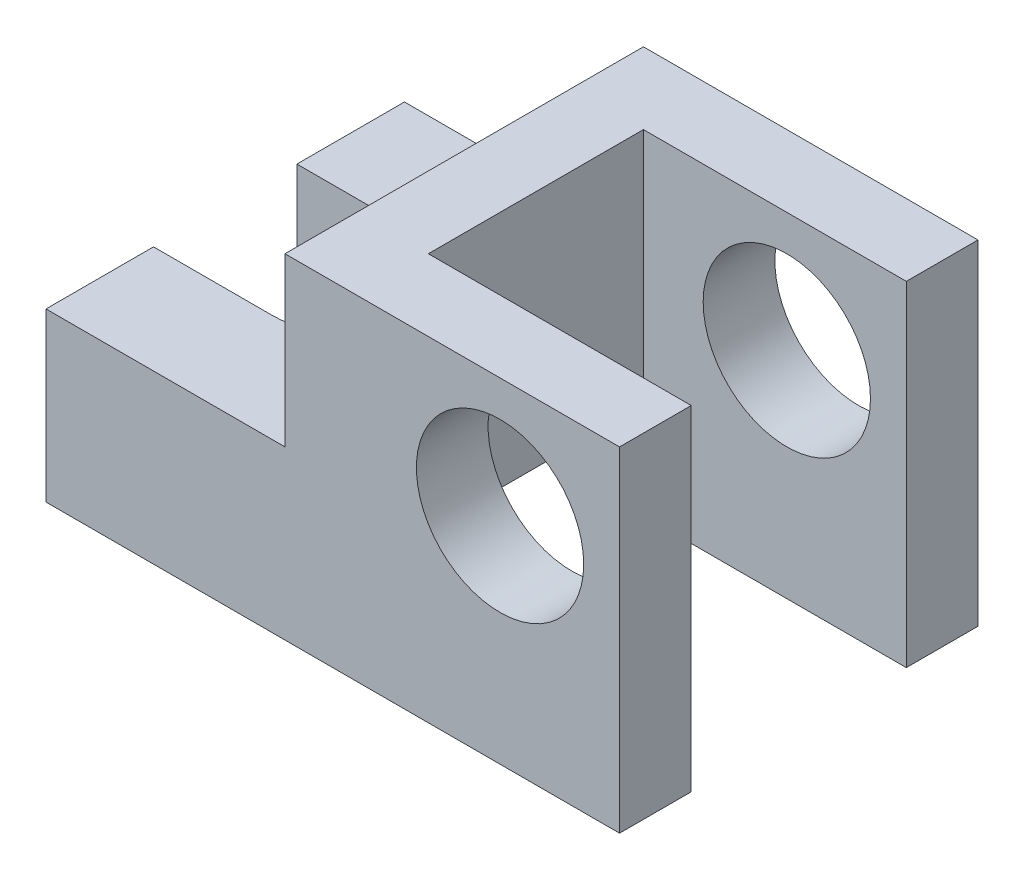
ISO-10303-21;
HEADER;
FILE_DESCRIPTION(('STEP AP214'),'2;1');
FILE_NAME('part.step','',(''),(''),'','','');
FILE_SCHEMA(('AUTOMOTIVE_DESIGN { 1 0 10303 214 1 1 1 1 }'));
ENDSEC;
DATA;
#1=APPLICATION_CONTEXT('core data for automotive mechanical design processes');
#2=APPLICATION_PROTOCOL_DEFINITION('international standard','automotive_design',2000,#1);
#3=PRODUCT_CONTEXT('',#1,'mechanical');
#4=PRODUCT('Part','Part','',(#3));
#5=PRODUCT_RELATED_PRODUCT_CATEGORY('part','',(#4));
#6=PRODUCT_DEFINITION_FORMATION('','',#4);
#7=PRODUCT_DEFINITION_CONTEXT('part definition',#1,'design');
#8=PRODUCT_DEFINITION('design','',#6,#7);
#9=PRODUCT_DEFINITION_SHAPE('','',#8);
#10=(LENGTH_UNIT() NAMED_UNIT(*) SI_UNIT(.MILLI.,.METRE.));
#11=(NAMED_UNIT(*) PLANE_ANGLE_UNIT() SI_UNIT($,.RADIAN.));
#12=(NAMED_UNIT(*) SI_UNIT($,.STERADIAN.) SOLID_ANGLE_UNIT());
#13=UNCERTAINTY_MEASURE_WITH_UNIT(LENGTH_MEASURE(1.E-05),#10,'distance_accuracy_value','');
#14=(GEOMETRIC_REPRESENTATION_CONTEXT(3) GLOBAL_UNCERTAINTY_ASSIGNED_CONTEXT((#13)) GLOBAL_UNIT_ASSIGNED_CONTEXT((#10,
#11,#12)) REPRESENTATION_CONTEXT('',''));
#15=CARTESIAN_POINT('',(0.,0.,0.));
#16=DIRECTION('',(0.,0.,1.));
#17=DIRECTION('',(1.,0.,0.));
#18=AXIS2_PLACEMENT_3D('',#15,#16,#17);
#19=CARTESIAN_POINT('',(48.,14.,0.));
#20=DIRECTION('',(-1.,0.,0.));
#21=DIRECTION('',(0.,0.,1.));
#22=AXIS2_PLACEMENT_3D('',#19,#20,#21);
#23=PLANE('',#22);
#24=DIRECTION('',(0.,1.,0.));
#25=VECTOR('',#24,1.);
#26=CARTESIAN_POINT('',(48.,0.,-5.99999999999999));
#27=LINE('',#26,#25);
#28=CARTESIAN_POINT('',(48.,0.,-5.99999999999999));
#29=VERTEX_POINT('',#28);
#30=CARTESIAN_POINT('',(48.,28.,-6.));
#31=VERTEX_POINT('',#30);
#32=EDGE_CURVE('E259',#29,#31,#27,.T.);
#33=ORIENTED_EDGE('',*,*,#32,.T.);
#34=DIRECTION('',(0.,0.,1.));
#35=VECTOR('',#34,1.);
#36=CARTESIAN_POINT('',(48.,28.,0.));
#37=LINE('',#36,#35);
#38=CARTESIAN_POINT('',(48.,28.,0.));
#39=VERTEX_POINT('',#38);
#40=EDGE_CURVE('E184',#31,#39,#37,.T.);
#41=ORIENTED_EDGE('',*,*,#40,.T.);
#42=DIRECTION('',(0.,-1.,0.));
#43=VECTOR('',#42,1.);
#44=CARTESIAN_POINT('',(48.,14.,0.));
#45=LINE('',#44,#43);
#46=CARTESIAN_POINT('',(48.,0.,0.));
#47=VERTEX_POINT('',#46);
#48=EDGE_CURVE('E236',#39,#47,#45,.T.);
#49=ORIENTED_EDGE('',*,*,#48,.T.);
#50=DIRECTION('',(0.,0.,-1.));
#51=VECTOR('',#50,1.);
#52=CARTESIAN_POINT('',(48.,0.,0.));
#53=LINE('',#52,#51);
#54=EDGE_CURVE('E225',#47,#29,#53,.T.);
#55=ORIENTED_EDGE('',*,*,#54,.T.);
#56=EDGE_LOOP('',(#33,#41,#49,#55));
#57=FACE_BOUND('',#56,.T.);
#58=ADVANCED_FACE('F33',(#57),#23,.F.);
#59=CARTESIAN_POINT('',(0.,14.,-30.));
#60=DIRECTION('',(0.,-1.,0.));
#61=DIRECTION('',(0.,0.,-1.));
#62=AXIS2_PLACEMENT_3D('',#59,#60,#61);
#63=PLANE('',#62);
#64=DIRECTION('',(0.,0.,1.));
#65=VECTOR('',#64,1.);
#66=CARTESIAN_POINT('',(20.,14.,0.));
#67=LINE('',#66,#65);
#68=CARTESIAN_POINT('',(20.,14.,-30.));
#69=VERTEX_POINT('',#68);
#70=CARTESIAN_POINT('',(20.,14.,0.));
#71=VERTEX_POINT('',#70);
#72=EDGE_CURVE('E58',#69,#71,#67,.T.);
#73=ORIENTED_EDGE('',*,*,#72,.F.);
#74=DIRECTION('',(-1.,0.,0.));
#75=VECTOR('',#74,1.);
#76=CARTESIAN_POINT('',(0.,14.,-30.));
#77=LINE('',#76,#75);
#78=CARTESIAN_POINT('',(0.,14.,-30.));
#79=VERTEX_POINT('',#78);
#80=EDGE_CURVE('E208',#69,#79,#77,.T.);
#81=ORIENTED_EDGE('',*,*,#80,.T.);
#82=DIRECTION('',(0.,0.,1.));
#83=VECTOR('',#82,1.);
#84=CARTESIAN_POINT('',(0.,14.,0.));
#85=LINE('',#84,#83);
#86=CARTESIAN_POINT('',(0.,14.,-21.));
#87=VERTEX_POINT('',#86);
#88=EDGE_CURVE('E299',#79,#87,#85,.T.);
#89=ORIENTED_EDGE('',*,*,#88,.T.);
#90=DIRECTION('',(-1.,0.,0.));
#91=VECTOR('',#90,1.);
#92=CARTESIAN_POINT('',(0.,14.,-21.));
#93=LINE('',#92,#91);
#94=CARTESIAN_POINT('',(10.,14.,-21.));
#95=VERTEX_POINT('',#94);
#96=EDGE_CURVE('E302',#95,#87,#93,.T.);
#97=ORIENTED_EDGE('',*,*,#96,.F.);
#98=CARTESIAN_POINT('',(10.,14.,-15.));
#99=DIRECTION('',(0.,1.,0.));
#100=DIRECTION('',(0.,0.,1.));
#101=AXIS2_PLACEMENT_3D('',#98,#99,#100);
#102=CIRCLE('',#101,6.);
#103=CARTESIAN_POINT('',(10.,14.,-9.));
#104=VERTEX_POINT('',#103);
#105=EDGE_CURVE('E313',#104,#95,#102,.T.);
#106=ORIENTED_EDGE('',*,*,#105,.F.);
#107=DIRECTION('',(1.,0.,0.));
#108=VECTOR('',#107,1.);
#109=CARTESIAN_POINT('',(0.,14.,-9.));
#110=LINE('',#109,#108);
#111=CARTESIAN_POINT('',(0.,14.,-9.));
#112=VERTEX_POINT('',#111);
#113=EDGE_CURVE('E316',#112,#104,#110,.T.);
#114=ORIENTED_EDGE('',*,*,#113,.F.);
#115=CARTESIAN_POINT('',(0.,14.,0.));
#116=VERTEX_POINT('',#115);
#117=EDGE_CURVE('E230',#112,#116,#85,.T.);
#118=ORIENTED_EDGE('',*,*,#117,.T.);
#119=DIRECTION('',(1.,0.,0.));
#120=VECTOR('',#119,1.);
#121=CARTESIAN_POINT('',(0.,14.,0.));
#122=LINE('',#121,#120);
#123=EDGE_CURVE('E212',#116,#71,#122,.T.);
#124=ORIENTED_EDGE('',*,*,#123,.T.);
#125=EDGE_LOOP('',(#73,#81,#89,#97,#106,#114,#118,#124));
#126=FACE_BOUND('',#125,.T.);
#127=ADVANCED_FACE('F274',(#126),#63,.F.);
#128=CARTESIAN_POINT('',(0.,0.,-30.));
#129=DIRECTION('',(0.,-1.,0.));
#130=DIRECTION('',(0.,0.,-1.));
#131=AXIS2_PLACEMENT_3D('',#128,#129,#130);
#132=PLANE('',#131);
#133=DIRECTION('',(-1.,0.,0.));
#134=VECTOR('',#133,1.);
#135=CARTESIAN_POINT('',(48.,0.,-24.));
#136=LINE('',#135,#134);
#137=CARTESIAN_POINT('',(48.,0.,-24.));
#138=VERTEX_POINT('',#137);
#139=CARTESIAN_POINT('',(0.,0.,-24.));
#140=VERTEX_POINT('',#139);
#141=EDGE_CURVE('E326',#138,#140,#136,.T.);
#142=ORIENTED_EDGE('',*,*,#141,.T.);
#143=DIRECTION('',(0.,0.,1.));
#144=VECTOR('',#143,1.);
#145=CARTESIAN_POINT('',(0.,0.,0.));
#146=LINE('',#145,#144);
#147=CARTESIAN_POINT('',(0.,0.,-30.));
#148=VERTEX_POINT('',#147);
#149=EDGE_CURVE('E218',#148,#140,#146,.T.);
#150=ORIENTED_EDGE('',*,*,#149,.F.);
#151=DIRECTION('',(-1.,0.,0.));
#152=VECTOR('',#151,1.);
#153=CARTESIAN_POINT('',(0.,0.,-30.));
#154=LINE('',#153,#152);
#155=CARTESIAN_POINT('',(48.,0.,-30.));
#156=VERTEX_POINT('',#155);
#157=EDGE_CURVE('E228',#156,#148,#154,.T.);
#158=ORIENTED_EDGE('',*,*,#157,.F.);
#159=EDGE_CURVE('E224',#138,#156,#53,.T.);
#160=ORIENTED_EDGE('',*,*,#159,.F.);
#161=EDGE_LOOP('',(#142,#150,#158,#160));
#162=FACE_BOUND('',#161,.T.);
#163=ADVANCED_FACE('F280',(#162),#132,.T.);
#164=CARTESIAN_POINT('',(0.,14.,0.));
#165=DIRECTION('',(1.,0.,0.));
#166=DIRECTION('',(0.,0.,-1.));
#167=AXIS2_PLACEMENT_3D('',#164,#165,#166);
#168=PLANE('',#167);
#169=ORIENTED_EDGE('',*,*,#149,.T.);
#170=DIRECTION('',(0.,-1.,0.));
#171=VECTOR('',#170,1.);
#172=CARTESIAN_POINT('',(0.,0.,-24.));
#173=LINE('',#172,#171);
#174=CARTESIAN_POINT('',(0.,8.,-24.));
#175=VERTEX_POINT('',#174);
#176=EDGE_CURVE('E187',#175,#140,#173,.T.);
#177=ORIENTED_EDGE('',*,*,#176,.F.);
#178=DIRECTION('',(0.,0.,-1.));
#179=VECTOR('',#178,1.);
#180=CARTESIAN_POINT('',(0.,8.,-24.));
#181=LINE('',#180,#179);
#182=CARTESIAN_POINT('',(0.,8.,-21.));
#183=VERTEX_POINT('',#182);
#184=EDGE_CURVE('E334',#183,#175,#181,.T.);
#185=ORIENTED_EDGE('',*,*,#184,.F.);
#186=DIRECTION('',(0.,1.,0.));
#187=VECTOR('',#186,1.);
#188=CARTESIAN_POINT('',(0.,0.,-21.));
#189=LINE('',#188,#187);
#190=EDGE_CURVE('E254',#183,#87,#189,.T.);
#191=ORIENTED_EDGE('',*,*,#190,.T.);
#192=ORIENTED_EDGE('',*,*,#88,.F.);
#193=DIRECTION('',(0.,-1.,0.));
#194=VECTOR('',#193,1.);
#195=CARTESIAN_POINT('',(0.,14.,-30.));
#196=LINE('',#195,#194);
#197=EDGE_CURVE('E211',#79,#148,#196,.T.);
#198=ORIENTED_EDGE('',*,*,#197,.T.);
#199=EDGE_LOOP('',(#169,#177,#185,#191,#192,#198));
#200=FACE_BOUND('',#199,.T.);
#201=ADVANCED_FACE('F341',(#200),#168,.F.);
#202=DIRECTION('',(0.,1.,0.));
#203=VECTOR('',#202,1.);
#204=CARTESIAN_POINT('',(0.,0.,-9.));
#205=LINE('',#204,#203);
#206=CARTESIAN_POINT('',(0.,8.,-9.));
#207=VERTEX_POINT('',#206);
#208=EDGE_CURVE('E305',#207,#112,#205,.T.);
#209=ORIENTED_EDGE('',*,*,#208,.F.);
#210=CARTESIAN_POINT('',(0.,8.,-6.));
#211=VERTEX_POINT('',#210);
#212=EDGE_CURVE('E332',#211,#207,#181,.T.);
#213=ORIENTED_EDGE('',*,*,#212,.F.);
#214=DIRECTION('',(0.,1.,0.));
#215=VECTOR('',#214,1.);
#216=CARTESIAN_POINT('',(0.,0.,-6.));
#217=LINE('',#216,#215);
#218=CARTESIAN_POINT('',(0.,0.,-6.));
#219=VERTEX_POINT('',#218);
#220=EDGE_CURVE('E251',#219,#211,#217,.T.);
#221=ORIENTED_EDGE('',*,*,#220,.F.);
#222=CARTESIAN_POINT('',(0.,0.,0.));
#223=VERTEX_POINT('',#222);
#224=EDGE_CURVE('E222',#219,#223,#146,.T.);
#225=ORIENTED_EDGE('',*,*,#224,.T.);
#226=DIRECTION('',(0.,-1.,0.));
#227=VECTOR('',#226,1.);
#228=CARTESIAN_POINT('',(0.,14.,0.));
#229=LINE('',#228,#227);
#230=EDGE_CURVE('E42',#116,#223,#229,.T.);
#231=ORIENTED_EDGE('',*,*,#230,.F.);
#232=ORIENTED_EDGE('',*,*,#117,.F.);
#233=EDGE_LOOP('',(#209,#213,#221,#225,#231,#232));
#234=FACE_BOUND('',#233,.T.);
#235=ADVANCED_FACE('F35',(#234),#168,.F.);
#236=CARTESIAN_POINT('',(0.,14.,0.));
#237=DIRECTION('',(0.,0.,-1.));
#238=DIRECTION('',(-1.,0.,0.));
#239=AXIS2_PLACEMENT_3D('',#236,#237,#238);
#240=PLANE('',#239);
#241=CARTESIAN_POINT('',(38.,18.,0.));
#242=DIRECTION('',(0.,0.,1.));
#243=DIRECTION('',(1.,0.,0.));
#244=AXIS2_PLACEMENT_3D('',#241,#242,#243);
#245=CIRCLE('',#244,7.);
#246=CARTESIAN_POINT('',(45.,18.,0.));
#247=VERTEX_POINT('',#246);
#248=EDGE_CURVE('E390',#247,#247,#245,.T.);
#249=ORIENTED_EDGE('',*,*,#248,.F.);
#250=EDGE_LOOP('',(#249));
#251=FACE_BOUND('',#250,.T.);
#252=DIRECTION('',(1.,0.,0.));
#253=VECTOR('',#252,1.);
#254=CARTESIAN_POINT('',(0.,0.,0.));
#255=LINE('',#254,#253);
#256=EDGE_CURVE('E221',#223,#47,#255,.T.);
#257=ORIENTED_EDGE('',*,*,#256,.T.);
#258=ORIENTED_EDGE('',*,*,#48,.F.);
#259=DIRECTION('',(-1.,0.,0.));
#260=VECTOR('',#259,1.);
#261=CARTESIAN_POINT('',(48.,28.,0.));
#262=LINE('',#261,#260);
#263=CARTESIAN_POINT('',(20.,28.,0.));
#264=VERTEX_POINT('',#263);
#265=EDGE_CURVE('E181',#39,#264,#262,.T.);
#266=ORIENTED_EDGE('',*,*,#265,.T.);
#267=DIRECTION('',(0.,-1.,0.));
#268=VECTOR('',#267,1.);
#269=CARTESIAN_POINT('',(20.,97.0365690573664,0.));
#270=LINE('',#269,#268);
#271=EDGE_CURVE('E194',#264,#71,#270,.T.);
#272=ORIENTED_EDGE('',*,*,#271,.T.);
#273=ORIENTED_EDGE('',*,*,#123,.F.);
#274=ORIENTED_EDGE('',*,*,#230,.T.);
#275=EDGE_LOOP('',(#257,#258,#266,#272,#273,#274));
#276=FACE_BOUND('',#275,.T.);
#277=ADVANCED_FACE('F241',(#251,#276),#240,.F.);
#278=CARTESIAN_POINT('',(48.,28.,-30.));
#279=VERTEX_POINT('',#278);
#280=CARTESIAN_POINT('',(48.,28.,-24.));
#281=VERTEX_POINT('',#280);
#282=EDGE_CURVE('E185',#279,#281,#37,.T.);
#283=ORIENTED_EDGE('',*,*,#282,.T.);
#284=DIRECTION('',(0.,-1.,0.));
#285=VECTOR('',#284,1.);
#286=CARTESIAN_POINT('',(48.,0.,-24.));
#287=LINE('',#286,#285);
#288=EDGE_CURVE('E50',#281,#138,#287,.T.);
#289=ORIENTED_EDGE('',*,*,#288,.T.);
#290=ORIENTED_EDGE('',*,*,#159,.T.);
#291=DIRECTION('',(0.,-1.,0.));
#292=VECTOR('',#291,1.);
#293=CARTESIAN_POINT('',(48.,14.,-30.));
#294=LINE('',#293,#292);
#295=EDGE_CURVE('E233',#279,#156,#294,.T.);
#296=ORIENTED_EDGE('',*,*,#295,.F.);
#297=EDGE_LOOP('',(#283,#289,#290,#296));
#298=FACE_BOUND('',#297,.T.);
#299=ADVANCED_FACE('F276',(#298),#23,.F.);
#300=CARTESIAN_POINT('',(0.,14.,-30.));
#301=DIRECTION('',(0.,0.,1.));
#302=DIRECTION('',(1.,0.,0.));
#303=AXIS2_PLACEMENT_3D('',#300,#301,#302);
#304=PLANE('',#303);
#305=CARTESIAN_POINT('',(38.,18.,-30.));
#306=DIRECTION('',(0.,0.,1.));
#307=DIRECTION('',(1.,0.,0.));
#308=AXIS2_PLACEMENT_3D('',#305,#306,#307);
#309=CIRCLE('',#308,7.);
#310=CARTESIAN_POINT('',(45.,18.,-30.));
#311=VERTEX_POINT('',#310);
#312=EDGE_CURVE('E166',#311,#311,#309,.T.);
#313=ORIENTED_EDGE('',*,*,#312,.T.);
#314=EDGE_LOOP('',(#313));
#315=FACE_BOUND('',#314,.T.);
#316=ORIENTED_EDGE('',*,*,#157,.T.);
#317=ORIENTED_EDGE('',*,*,#197,.F.);
#318=ORIENTED_EDGE('',*,*,#80,.F.);
#319=DIRECTION('',(0.,-1.,0.));
#320=VECTOR('',#319,1.);
#321=CARTESIAN_POINT('',(20.,97.0365690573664,-30.));
#322=LINE('',#321,#320);
#323=CARTESIAN_POINT('',(20.,28.,-30.));
#324=VERTEX_POINT('',#323);
#325=EDGE_CURVE('E197',#324,#69,#322,.T.);
#326=ORIENTED_EDGE('',*,*,#325,.F.);
#327=DIRECTION('',(1.,0.,0.));
#328=VECTOR('',#327,1.);
#329=CARTESIAN_POINT('',(48.,28.,-30.));
#330=LINE('',#329,#328);
#331=EDGE_CURVE('E180',#324,#279,#330,.T.);
#332=ORIENTED_EDGE('',*,*,#331,.T.);
#333=ORIENTED_EDGE('',*,*,#295,.T.);
#334=EDGE_LOOP('',(#316,#317,#318,#326,#332,#333));
#335=FACE_BOUND('',#334,.T.);
#336=ADVANCED_FACE('F284',(#315,#335),#304,.F.);
#337=DIRECTION('',(-1.,0.,0.));
#338=VECTOR('',#337,1.);
#339=CARTESIAN_POINT('',(48.,0.,-5.99999999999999));
#340=LINE('',#339,#338);
#341=EDGE_CURVE('E257',#29,#219,#340,.T.);
#342=ORIENTED_EDGE('',*,*,#341,.F.);
#343=ORIENTED_EDGE('',*,*,#54,.F.);
#344=ORIENTED_EDGE('',*,*,#256,.F.);
#345=ORIENTED_EDGE('',*,*,#224,.F.);
#346=EDGE_LOOP('',(#342,#343,#344,#345));
#347=FACE_BOUND('',#346,.T.);
#348=ADVANCED_FACE('F256',(#347),#132,.T.);
#349=CARTESIAN_POINT('',(0.,0.,-21.));
#350=DIRECTION('',(0.,0.,-1.));
#351=DIRECTION('',(-1.,0.,0.));
#352=AXIS2_PLACEMENT_3D('',#349,#350,#351);
#353=PLANE('',#352);
#354=ORIENTED_EDGE('',*,*,#190,.F.);
#355=DIRECTION('',(1.,0.,0.));
#356=VECTOR('',#355,1.);
#357=CARTESIAN_POINT('',(0.,8.,-21.));
#358=LINE('',#357,#356);
#359=CARTESIAN_POINT('',(10.,8.,-21.));
#360=VERTEX_POINT('',#359);
#361=EDGE_CURVE('E319',#183,#360,#358,.T.);
#362=ORIENTED_EDGE('',*,*,#361,.T.);
#363=DIRECTION('',(0.,1.,0.));
#364=VECTOR('',#363,1.);
#365=CARTESIAN_POINT('',(10.,0.,-21.));
#366=LINE('',#365,#364);
#367=EDGE_CURVE('E309',#360,#95,#366,.T.);
#368=ORIENTED_EDGE('',*,*,#367,.T.);
#369=ORIENTED_EDGE('',*,*,#96,.T.);
#370=EDGE_LOOP('',(#354,#362,#368,#369));
#371=FACE_BOUND('',#370,.T.);
#372=ADVANCED_FACE('F349',(#371),#353,.F.);
#373=CARTESIAN_POINT('',(10.,0.,-15.));
#374=DIRECTION('',(0.,1.,0.));
#375=DIRECTION('',(0.,0.,1.));
#376=AXIS2_PLACEMENT_3D('',#373,#374,#375);
#377=CYLINDRICAL_SURFACE('',#376,6.);
#378=ORIENTED_EDGE('',*,*,#367,.F.);
#379=CARTESIAN_POINT('',(10.,8.,-15.));
#380=DIRECTION('',(0.,1.,0.));
#381=DIRECTION('',(0.,0.,1.));
#382=AXIS2_PLACEMENT_3D('',#379,#380,#381);
#383=CIRCLE('',#382,6.);
#384=CARTESIAN_POINT('',(10.,8.,-9.));
#385=VERTEX_POINT('',#384);
#386=EDGE_CURVE('E322',#360,#385,#383,.F.);
#387=ORIENTED_EDGE('',*,*,#386,.T.);
#388=DIRECTION('',(0.,1.,0.));
#389=VECTOR('',#388,1.);
#390=CARTESIAN_POINT('',(10.,0.,-9.));
#391=LINE('',#390,#389);
#392=EDGE_CURVE('E307',#385,#104,#391,.T.);
#393=ORIENTED_EDGE('',*,*,#392,.T.);
#394=ORIENTED_EDGE('',*,*,#105,.T.);
#395=EDGE_LOOP('',(#378,#387,#393,#394));
#396=FACE_BOUND('',#395,.T.);
#397=ADVANCED_FACE('F353',(#396),#377,.F.);
#398=CARTESIAN_POINT('',(0.,0.,-9.));
#399=DIRECTION('',(0.,0.,1.));
#400=DIRECTION('',(1.,0.,0.));
#401=AXIS2_PLACEMENT_3D('',#398,#399,#400);
#402=PLANE('',#401);
#403=ORIENTED_EDGE('',*,*,#392,.F.);
#404=DIRECTION('',(-1.,0.,0.));
#405=VECTOR('',#404,1.);
#406=CARTESIAN_POINT('',(0.,8.,-9.));
#407=LINE('',#406,#405);
#408=EDGE_CURVE('E12',#385,#207,#407,.T.);
#409=ORIENTED_EDGE('',*,*,#408,.T.);
#410=ORIENTED_EDGE('',*,*,#208,.T.);
#411=ORIENTED_EDGE('',*,*,#113,.T.);
#412=EDGE_LOOP('',(#403,#409,#410,#411));
#413=FACE_BOUND('',#412,.T.);
#414=ADVANCED_FACE('F359',(#413),#402,.F.);
#415=CARTESIAN_POINT('',(48.,8.,-24.));
#416=DIRECTION('',(0.,1.,0.));
#417=DIRECTION('',(0.,0.,1.));
#418=AXIS2_PLACEMENT_3D('',#415,#416,#417);
#419=PLANE('',#418);
#420=DIRECTION('',(-1.,0.,0.));
#421=VECTOR('',#420,1.);
#422=CARTESIAN_POINT('',(48.,8.,-24.));
#423=LINE('',#422,#421);
#424=CARTESIAN_POINT('',(26.,8.,-24.));
#425=VERTEX_POINT('',#424);
#426=EDGE_CURVE('E325',#425,#175,#423,.T.);
#427=ORIENTED_EDGE('',*,*,#426,.F.);
#428=DIRECTION('',(0.,0.,1.));
#429=VECTOR('',#428,1.);
#430=CARTESIAN_POINT('',(26.,8.,-24.));
#431=LINE('',#430,#429);
#432=CARTESIAN_POINT('',(26.,8.,-6.));
#433=VERTEX_POINT('',#432);
#434=EDGE_CURVE('E155',#425,#433,#431,.T.);
#435=ORIENTED_EDGE('',*,*,#434,.T.);
#436=DIRECTION('',(-1.,0.,0.));
#437=VECTOR('',#436,1.);
#438=CARTESIAN_POINT('',(48.,8.,-5.99999999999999));
#439=LINE('',#438,#437);
#440=EDGE_CURVE('E329',#433,#211,#439,.T.);
#441=ORIENTED_EDGE('',*,*,#440,.T.);
#442=ORIENTED_EDGE('',*,*,#212,.T.);
#443=ORIENTED_EDGE('',*,*,#408,.F.);
#444=ORIENTED_EDGE('',*,*,#386,.F.);
#445=ORIENTED_EDGE('',*,*,#361,.F.);
#446=ORIENTED_EDGE('',*,*,#184,.T.);
#447=EDGE_LOOP('',(#427,#435,#441,#442,#443,#444,#445,#446));
#448=FACE_BOUND('',#447,.T.);
#449=ADVANCED_FACE('F366',(#448),#419,.F.);
#450=CARTESIAN_POINT('',(48.,0.,-24.));
#451=DIRECTION('',(0.,0.,-1.));
#452=DIRECTION('',(-1.,0.,0.));
#453=AXIS2_PLACEMENT_3D('',#450,#451,#452);
#454=PLANE('',#453);
#455=CARTESIAN_POINT('',(38.,18.,-24.));
#456=DIRECTION('',(0.,0.,-1.));
#457=DIRECTION('',(-1.,0.,0.));
#458=AXIS2_PLACEMENT_3D('',#455,#456,#457);
#459=CIRCLE('',#458,7.);
#460=CARTESIAN_POINT('',(31.,18.,-24.));
#461=VERTEX_POINT('',#460);
#462=EDGE_CURVE('E385',#461,#461,#459,.T.);
#463=ORIENTED_EDGE('',*,*,#462,.T.);
#464=EDGE_LOOP('',(#463));
#465=FACE_BOUND('',#464,.T.);
#466=ORIENTED_EDGE('',*,*,#176,.T.);
#467=ORIENTED_EDGE('',*,*,#141,.F.);
#468=ORIENTED_EDGE('',*,*,#288,.F.);
#469=DIRECTION('',(-1.,0.,0.));
#470=VECTOR('',#469,1.);
#471=CARTESIAN_POINT('',(48.,28.,-24.));
#472=LINE('',#471,#470);
#473=CARTESIAN_POINT('',(26.,28.,-24.));
#474=VERTEX_POINT('',#473);
#475=EDGE_CURVE('E160',#281,#474,#472,.T.);
#476=ORIENTED_EDGE('',*,*,#475,.T.);
#477=DIRECTION('',(0.,1.,0.));
#478=VECTOR('',#477,1.);
#479=CARTESIAN_POINT('',(26.,0.,-24.));
#480=LINE('',#479,#478);
#481=EDGE_CURVE('E149',#425,#474,#480,.T.);
#482=ORIENTED_EDGE('',*,*,#481,.F.);
#483=ORIENTED_EDGE('',*,*,#426,.T.);
#484=EDGE_LOOP('',(#466,#467,#468,#476,#482,#483));
#485=FACE_BOUND('',#484,.T.);
#486=ADVANCED_FACE('F162',(#465,#485),#454,.F.);
#487=CARTESIAN_POINT('',(48.,0.,-5.99999999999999));
#488=DIRECTION('',(0.,0.,1.));
#489=DIRECTION('',(1.,0.,0.));
#490=AXIS2_PLACEMENT_3D('',#487,#488,#489);
#491=PLANE('',#490);
#492=CARTESIAN_POINT('',(38.,18.,-5.99999999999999));
#493=DIRECTION('',(0.,0.,1.));
#494=DIRECTION('',(1.,0.,0.));
#495=AXIS2_PLACEMENT_3D('',#492,#493,#494);
#496=CIRCLE('',#495,7.);
#497=CARTESIAN_POINT('',(45.,18.,-5.99999999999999));
#498=VERTEX_POINT('',#497);
#499=EDGE_CURVE('E37',#498,#498,#496,.T.);
#500=ORIENTED_EDGE('',*,*,#499,.T.);
#501=EDGE_LOOP('',(#500));
#502=FACE_BOUND('',#501,.T.);
#503=ORIENTED_EDGE('',*,*,#440,.F.);
#504=DIRECTION('',(0.,1.,0.));
#505=VECTOR('',#504,1.);
#506=CARTESIAN_POINT('',(26.,0.,-6.));
#507=LINE('',#506,#505);
#508=CARTESIAN_POINT('',(26.,28.,-6.));
#509=VERTEX_POINT('',#508);
#510=EDGE_CURVE('E157',#433,#509,#507,.T.);
#511=ORIENTED_EDGE('',*,*,#510,.T.);
#512=DIRECTION('',(1.,0.,0.));
#513=VECTOR('',#512,1.);
#514=CARTESIAN_POINT('',(48.,28.,-6.));
#515=LINE('',#514,#513);
#516=EDGE_CURVE('E158',#509,#31,#515,.T.);
#517=ORIENTED_EDGE('',*,*,#516,.T.);
#518=ORIENTED_EDGE('',*,*,#32,.F.);
#519=ORIENTED_EDGE('',*,*,#341,.T.);
#520=ORIENTED_EDGE('',*,*,#220,.T.);
#521=EDGE_LOOP('',(#503,#511,#517,#518,#519,#520));
#522=FACE_BOUND('',#521,.T.);
#523=ADVANCED_FACE('F263',(#502,#522),#491,.F.);
#524=CARTESIAN_POINT('',(20.,97.0365690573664,0.));
#525=DIRECTION('',(1.,0.,0.));
#526=DIRECTION('',(0.,0.,-1.));
#527=AXIS2_PLACEMENT_3D('',#524,#525,#526);
#528=PLANE('',#527);
#529=ORIENTED_EDGE('',*,*,#271,.F.);
#530=DIRECTION('',(0.,0.,-1.));
#531=VECTOR('',#530,1.);
#532=CARTESIAN_POINT('',(20.,28.,0.));
#533=LINE('',#532,#531);
#534=EDGE_CURVE('E177',#264,#324,#533,.T.);
#535=ORIENTED_EDGE('',*,*,#534,.T.);
#536=ORIENTED_EDGE('',*,*,#325,.T.);
#537=ORIENTED_EDGE('',*,*,#72,.T.);
#538=EDGE_LOOP('',(#529,#535,#536,#537));
#539=FACE_BOUND('',#538,.T.);
#540=ADVANCED_FACE('F261',(#539),#528,.F.);
#541=CARTESIAN_POINT('',(0.,28.,-30.));
#542=DIRECTION('',(0.,-1.,0.));
#543=DIRECTION('',(0.,0.,-1.));
#544=AXIS2_PLACEMENT_3D('',#541,#542,#543);
#545=PLANE('',#544);
#546=ORIENTED_EDGE('',*,*,#40,.F.);
#547=ORIENTED_EDGE('',*,*,#516,.F.);
#548=DIRECTION('',(0.,0.,1.));
#549=VECTOR('',#548,1.);
#550=CARTESIAN_POINT('',(26.,28.,-24.));
#551=LINE('',#550,#549);
#552=EDGE_CURVE('E152',#474,#509,#551,.T.);
#553=ORIENTED_EDGE('',*,*,#552,.F.);
#554=ORIENTED_EDGE('',*,*,#475,.F.);
#555=ORIENTED_EDGE('',*,*,#282,.F.);
#556=ORIENTED_EDGE('',*,*,#331,.F.);
#557=ORIENTED_EDGE('',*,*,#534,.F.);
#558=ORIENTED_EDGE('',*,*,#265,.F.);
#559=EDGE_LOOP('',(#546,#547,#553,#554,#555,#556,#557,#558));
#560=FACE_BOUND('',#559,.T.);
#561=ADVANCED_FACE('F169',(#560),#545,.F.);
#562=CARTESIAN_POINT('',(26.,0.,-24.));
#563=DIRECTION('',(-1.,0.,0.));
#564=DIRECTION('',(0.,0.,1.));
#565=AXIS2_PLACEMENT_3D('',#562,#563,#564);
#566=PLANE('',#565);
#567=ORIENTED_EDGE('',*,*,#481,.T.);
#568=ORIENTED_EDGE('',*,*,#552,.T.);
#569=ORIENTED_EDGE('',*,*,#510,.F.);
#570=ORIENTED_EDGE('',*,*,#434,.F.);
#571=EDGE_LOOP('',(#567,#568,#569,#570));
#572=FACE_BOUND('',#571,.T.);
#573=ADVANCED_FACE('F150',(#572),#566,.F.);
#574=CARTESIAN_POINT('',(38.,18.,-30.00005));
#575=DIRECTION('',(0.,0.,1.));
#576=DIRECTION('',(1.,0.,0.));
#577=AXIS2_PLACEMENT_3D('',#574,#575,#576);
#578=CYLINDRICAL_SURFACE('',#577,7.);
#579=ORIENTED_EDGE('',*,*,#248,.T.);
#580=EDGE_LOOP('',(#579));
#581=FACE_BOUND('',#580,.T.);
#582=ORIENTED_EDGE('',*,*,#499,.F.);
#583=EDGE_LOOP('',(#582));
#584=FACE_BOUND('',#583,.T.);
#585=ADVANCED_FACE('F395',(#581,#584),#578,.F.);
#586=ORIENTED_EDGE('',*,*,#462,.F.);
#587=EDGE_LOOP('',(#586));
#588=FACE_BOUND('',#587,.T.);
#589=ORIENTED_EDGE('',*,*,#312,.F.);
#590=EDGE_LOOP('',(#589));
#591=FACE_BOUND('',#590,.T.);
#592=ADVANCED_FACE('F398',(#588,#591),#578,.F.);
#593=CLOSED_SHELL('',(#58,#127,#163,#201,#235,#277,#299,#336,#348,#372,#397,#414,#449,#486,#523,
#540,#561,#573,#585,#592));
#594=MANIFOLD_SOLID_BREP('B2',#593);
#595=ADVANCED_BREP_SHAPE_REPRESENTATION('',(#18,#594),#14);
#596=SHAPE_DEFINITION_REPRESENTATION(#9,#595);
ENDSEC;
END-ISO-10303-21;
